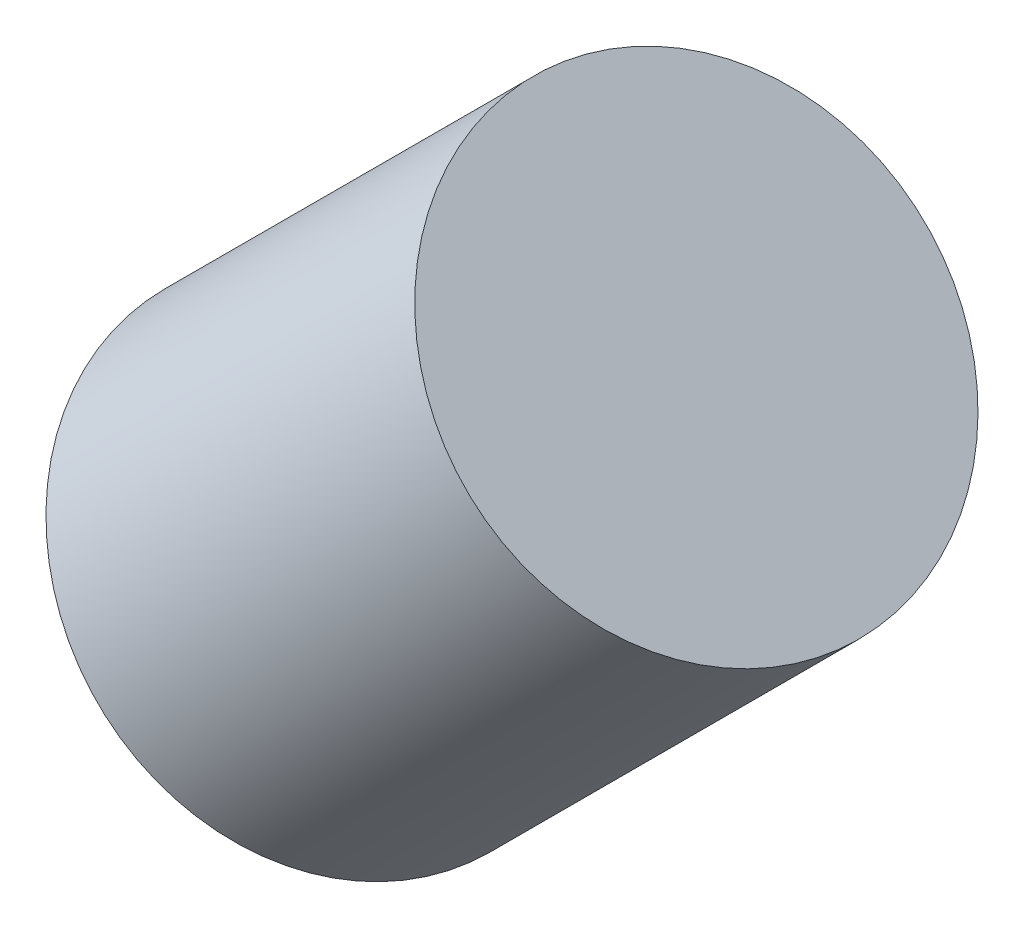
ISO-10303-21;
HEADER;
FILE_DESCRIPTION(('STEP AP214'),'2;1');
FILE_NAME('part.step','',(''),(''),'','','');
FILE_SCHEMA(('AUTOMOTIVE_DESIGN { 1 0 10303 214 1 1 1 1 }'));
ENDSEC;
DATA;
#1=APPLICATION_CONTEXT('core data for automotive mechanical design processes');
#2=APPLICATION_PROTOCOL_DEFINITION('international standard','automotive_design',2000,#1);
#3=PRODUCT_CONTEXT('',#1,'mechanical');
#4=PRODUCT('Part','Part','',(#3));
#5=PRODUCT_RELATED_PRODUCT_CATEGORY('part','',(#4));
#6=PRODUCT_DEFINITION_FORMATION('','',#4);
#7=PRODUCT_DEFINITION_CONTEXT('part definition',#1,'design');
#8=PRODUCT_DEFINITION('design','',#6,#7);
#9=PRODUCT_DEFINITION_SHAPE('','',#8);
#10=(LENGTH_UNIT() NAMED_UNIT(*) SI_UNIT(.MILLI.,.METRE.));
#11=(NAMED_UNIT(*) PLANE_ANGLE_UNIT() SI_UNIT($,.RADIAN.));
#12=(NAMED_UNIT(*) SI_UNIT($,.STERADIAN.) SOLID_ANGLE_UNIT());
#13=UNCERTAINTY_MEASURE_WITH_UNIT(LENGTH_MEASURE(1.E-05),#10,'distance_accuracy_value','');
#14=(GEOMETRIC_REPRESENTATION_CONTEXT(3) GLOBAL_UNCERTAINTY_ASSIGNED_CONTEXT((#13)) GLOBAL_UNIT_ASSIGNED_CONTEXT((#10,
#11,#12)) REPRESENTATION_CONTEXT('',''));
#15=CARTESIAN_POINT('',(0.,0.,0.));
#16=DIRECTION('',(0.,0.,1.));
#17=DIRECTION('',(1.,0.,0.));
#18=AXIS2_PLACEMENT_3D('',#15,#16,#17);
#19=CARTESIAN_POINT('',(15.994002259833,26.8371173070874,0.));
#20=DIRECTION('',(0.707106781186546,0.707106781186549,0.));
#21=DIRECTION('',(-0.707106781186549,0.707106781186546,0.));
#22=AXIS2_PLACEMENT_3D('',#19,#20,#21);
#23=CONICAL_SURFACE('',#22,1.49999999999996,1.19139606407);
#24=CARTESIAN_POINT('',(15.5710985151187,26.4142135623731,0.));
#25=VERTEX_POINT('',#24);
#26=VERTEX_LOOP('',#25);
#27=FACE_BOUND('',#26,.T.);
#28=CARTESIAN_POINT('',(15.994002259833,26.8371173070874,0.));
#29=DIRECTION('',(-0.707106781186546,-0.707106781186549,0.));
#30=DIRECTION('',(0.707106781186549,-0.707106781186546,0.));
#31=AXIS2_PLACEMENT_3D('',#28,#29,#30);
#32=CIRCLE('',#31,1.49999999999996);
#33=CARTESIAN_POINT('',(17.0546624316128,25.7764571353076,0.));
#34=VERTEX_POINT('',#33);
#35=EDGE_CURVE('E11',#34,#34,#32,.T.);
#36=ORIENTED_EDGE('',*,*,#35,.T.);
#37=EDGE_LOOP('',(#36));
#38=FACE_BOUND('',#37,.T.);
#39=ADVANCED_FACE('F31',(#27,#38),#23,.T.);
#40=CARTESIAN_POINT('',(14.1568849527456,25.,0.));
#41=DIRECTION('',(-0.707106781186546,-0.707106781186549,0.));
#42=DIRECTION('',(0.707106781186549,-0.707106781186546,0.));
#43=AXIS2_PLACEMENT_3D('',#40,#41,#42);
#44=CYLINDRICAL_SURFACE('',#43,1.49999999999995);
#45=ORIENTED_EDGE('',*,*,#35,.F.);
#46=EDGE_LOOP('',(#45));
#47=FACE_BOUND('',#46,.T.);
#48=CARTESIAN_POINT('',(18.3995256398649,29.2426406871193,0.));
#49=DIRECTION('',(-0.707106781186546,-0.707106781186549,0.));
#50=DIRECTION('',(0.707106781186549,-0.707106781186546,0.));
#51=AXIS2_PLACEMENT_3D('',#48,#49,#50);
#52=CIRCLE('',#51,1.49999999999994);
#53=CARTESIAN_POINT('',(19.4601858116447,28.1819805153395,0.));
#54=VERTEX_POINT('',#53);
#55=EDGE_CURVE('E37',#54,#54,#52,.T.);
#56=ORIENTED_EDGE('',*,*,#55,.T.);
#57=EDGE_LOOP('',(#56));
#58=FACE_BOUND('',#57,.T.);
#59=ADVANCED_FACE('F42',(#47,#58),#44,.T.);
#60=CARTESIAN_POINT('',(18.3995256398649,29.2426406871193,0.));
#61=DIRECTION('',(-0.707106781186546,-0.707106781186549,0.));
#62=DIRECTION('',(0.707106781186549,-0.707106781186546,0.));
#63=AXIS2_PLACEMENT_3D('',#60,#61,#62);
#64=PLANE('',#63);
#65=ORIENTED_EDGE('',*,*,#55,.F.);
#66=EDGE_LOOP('',(#65));
#67=FACE_BOUND('',#66,.T.);
#68=ADVANCED_FACE('F47',(#67),#64,.F.);
#69=CLOSED_SHELL('',(#39,#59,#68));
#70=MANIFOLD_SOLID_BREP('B2',#69);
#71=ADVANCED_BREP_SHAPE_REPRESENTATION('',(#18,#70),#14);
#72=SHAPE_DEFINITION_REPRESENTATION(#9,#71);
ENDSEC;
END-ISO-10303-21;
